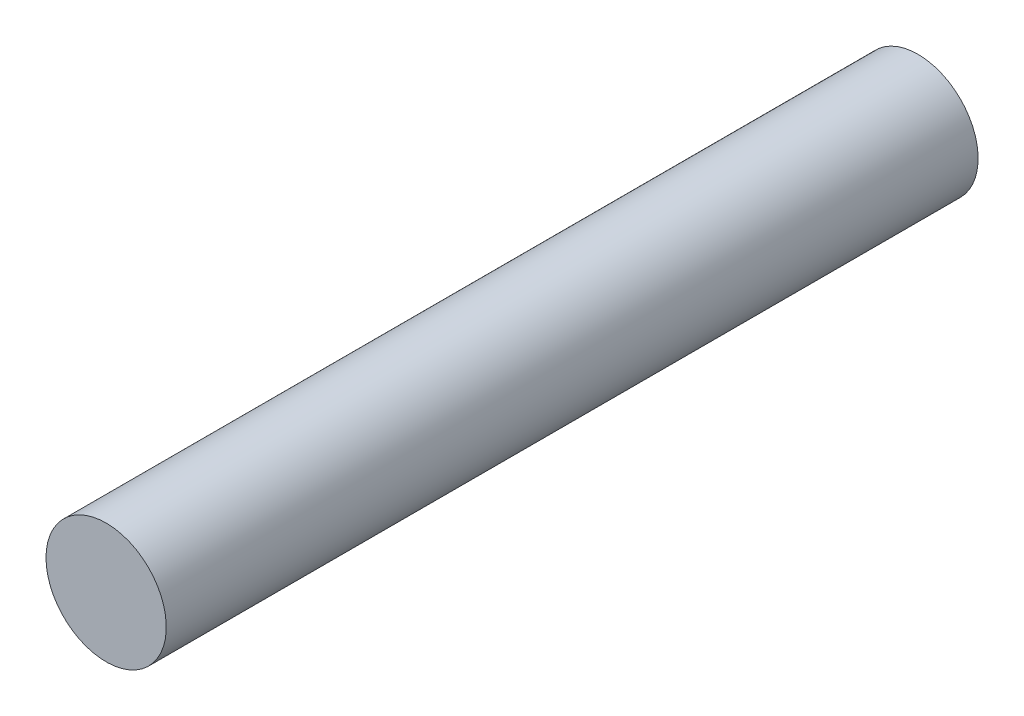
from build123d import *

# Parameters (mm, degrees)
ESQUISSE1_R            = 1
CYLINDRE_DE_BASE_DEPTH = 6.75


with BuildPart() as part:
    # Esquisse1 → Cylindre de base (new, symmetric)
    with BuildSketch(Plane.XY):
        with Locations(Location((0, 0, 0), (0, 0, 180))):
            Circle(ESQUISSE1_R)
    extrude(amount=CYLINDRE_DE_BASE_DEPTH, both=True)


solid = part.part
